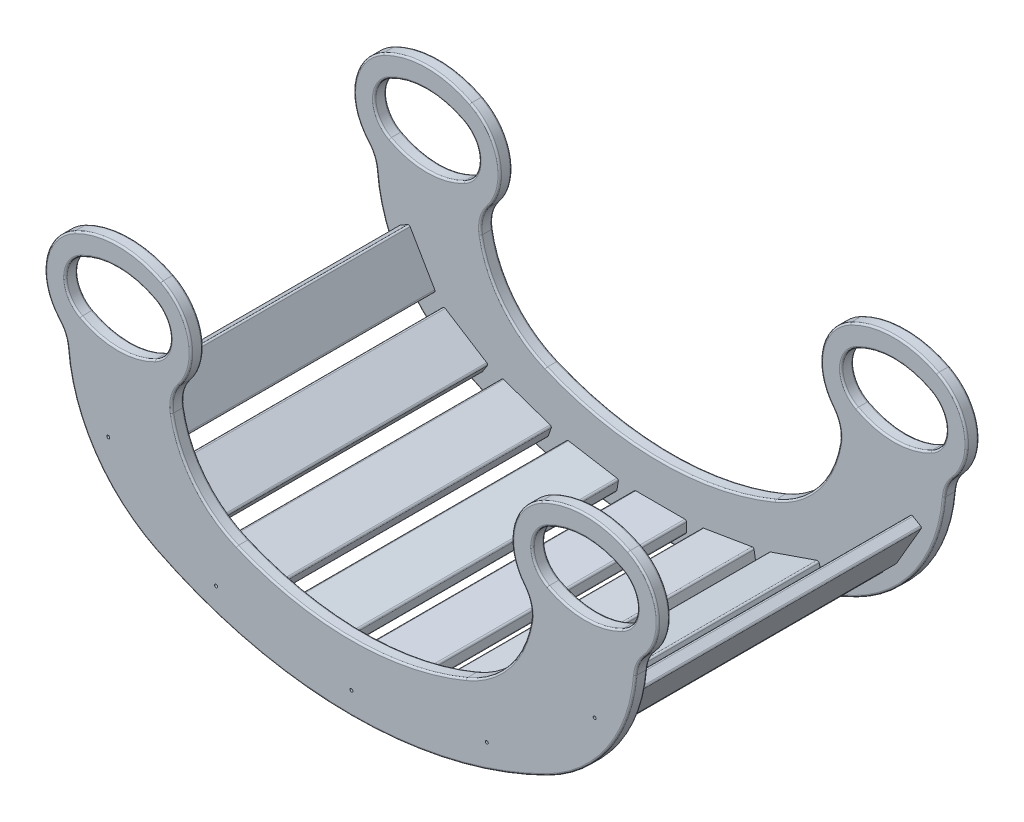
from build123d import *

# Parameters (mm, degrees)
SKETCH_2_W          = 90
SKETCH_2_H          = 21
EXTRUDE_1_DEPTH     = 10
EXTRUDE_START       = -11
EXTRUDE_2_DEPTH     = 11
SKETCH_4_R          = 2.5
CUT_EXTRUDE_1_DEPTH = 1164.159920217
FILLET_2_R          = 3
EXTRUDE_3_DEPTH     = 528
EXTRUDE_3_2_DEPTH   = 528
EXTRUDE_3_3_DEPTH   = 528
EXTRUDE_3_4_DEPTH   = 528
EXTRUDE_3_5_DEPTH   = 528
EXTRUDE_3_6_DEPTH   = 528
EXTRUDE_3_7_DEPTH   = 528
EXTRUDE_3_8_DEPTH   = 528
EXTRUDE_3_9_DEPTH   = 528
FILLET_3_R          = 3


with BuildPart() as part:
    # Sketch 2 → Extrude 1 (new body)
    with BuildSketch(Plane.XY):
        with BuildLine():
            ThreePointArc((50.245550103, 481.928030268), (125, 500), (199.754449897, 481.928030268))
            ThreePointArc((199.754449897, 481.928030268), (247.940880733, 419.051775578), (229.795836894, 341.940732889))
            ThreePointArc((229.795836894, 341.940732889), (218.622786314, 319.61675649), (217.501842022, 294.678022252))
            ThreePointArc((217.501842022, 294.678022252), (255.030373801, 210.070423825), (328.846153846, 154.230769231))
            ThreePointArc((328.846153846, 154.230769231), (525, 115), (721.153846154, 154.230769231))
            ThreePointArc((721.153846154, 154.230769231), (794.969626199, 210.070423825), (832.498157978, 294.678022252))
            ThreePointArc((832.498157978, 294.678022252), (831.377213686, 319.61675649), (820.204163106, 341.940732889))
            ThreePointArc((820.204163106, 341.940732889), (802.059119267, 419.051775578), (850.245550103, 481.928030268))
            ThreePointArc((850.245550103, 481.928030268), (925, 500), (999.754449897, 481.928030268))
            ThreePointArc((999.754449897, 481.928030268), (1048.461325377, 416.444496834), (1026.361057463, 337.882221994))
            ThreePointArc((1026.361057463, 337.882221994), (1015.908947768, 321.526061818), (1011.225482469, 302.688978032))
            ThreePointArc((1011.225482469, 302.688978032), (964.945149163, 170.966936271), (859.945317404, 78.947368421))
            ThreePointArc((859.945317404, 78.947368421), (525, 0), (190.054682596, 78.947368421))
            ThreePointArc((190.054682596, 78.947368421), (85.054850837, 170.966936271), (38.774517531, 302.688978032))
            ThreePointArc((38.774517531, 302.688978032), (34.091052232, 321.526061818), (23.638942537, 337.882221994))
            ThreePointArc((23.638942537, 337.882221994), (1.538674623, 416.444496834), (50.245550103, 481.928030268))
        make_face()
        Polygon((76.75766766, 239.64235719), (122.030807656, 161.858407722), (140.180395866, 172.422140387), (94.90725587, 250.206089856), align=None, mode=Mode.SUBTRACT)
        Polygon((142.852262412, 140.2605601), (218.927417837, 92.171364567), (230.148230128, 109.922234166), (154.073074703, 158.0114297), align=None, mode=Mode.SUBTRACT)
        Polygon((247.177476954, 82.075119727), (332.264757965, 52.746727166), (339.108049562, 72.600426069), (254.020768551, 101.928818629), align=None, mode=Mode.SUBTRACT)
        Polygon((361.339910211, 45.355142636), (450.103233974, 30.486640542), (453.572551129, 51.198082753), (364.809227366, 66.066584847), align=None, mode=Mode.SUBTRACT)
        with Locations((525, 38.5)):
            Rectangle(SKETCH_2_W, SKETCH_2_H, mode=Mode.SUBTRACT)
        Polygon((599.896766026, 30.486640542), (688.660089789, 45.355142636), (685.190772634, 66.066584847), (596.427448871, 51.198082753), align=None, mode=Mode.SUBTRACT)
        Polygon((717.735242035, 52.746727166), (802.822523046, 82.075119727), (795.979231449, 101.928818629), (710.891950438, 72.600426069), align=None, mode=Mode.SUBTRACT)
        Polygon((831.072582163, 92.171364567), (907.147737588, 140.2605601), (895.926925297, 158.0114297), (819.851769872, 109.922234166), align=None, mode=Mode.SUBTRACT)
        Polygon((909.819604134, 172.422140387), (927.969192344, 161.858407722), (973.24233234, 239.64235719), (955.09274413, 250.206089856), align=None, mode=Mode.SUBTRACT)
        with BuildLine():
            ThreePointArc((61.470588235, 449.117647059), (125, 465), (188.529411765, 449.117647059))
            ThreePointArc((188.529411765, 449.117647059), (215, 405), (188.529411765, 360.882352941))
            ThreePointArc((188.529411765, 360.882352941), (125, 345), (61.470588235, 360.882352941))
            ThreePointArc((61.470588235, 360.882352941), (35, 405), (61.470588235, 449.117647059))
        make_face(mode=Mode.SUBTRACT)
        with BuildLine():
            ThreePointArc((861.470588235, 449.117647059), (925, 465), (988.529411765, 449.117647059))
            ThreePointArc((988.529411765, 449.117647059), (1015, 405), (988.529411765, 360.882352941))
            ThreePointArc((988.529411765, 360.882352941), (925, 345), (861.470588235, 360.882352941))
            ThreePointArc((861.470588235, 360.882352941), (835, 405), (861.470588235, 449.117647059))
        make_face(mode=Mode.SUBTRACT)
    extrude(amount=EXTRUDE_1_DEPTH)

    # Sketch 2_2 → Extrude 2 (add)
    with BuildSketch(Plane.XY.offset(EXTRUDE_START)):
        with BuildLine():
            ThreePointArc((50.245550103, 481.928030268), (125, 500), (199.754449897, 481.928030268))
            ThreePointArc((199.754449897, 481.928030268), (247.940880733, 419.051775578), (229.795836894, 341.940732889))
            ThreePointArc((229.795836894, 341.940732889), (218.622786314, 319.61675649), (217.501842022, 294.678022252))
            ThreePointArc((217.501842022, 294.678022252), (255.030373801, 210.070423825), (328.846153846, 154.230769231))
            ThreePointArc((328.846153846, 154.230769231), (525, 115), (721.153846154, 154.230769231))
            ThreePointArc((721.153846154, 154.230769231), (794.969626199, 210.070423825), (832.498157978, 294.678022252))
            ThreePointArc((832.498157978, 294.678022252), (831.377213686, 319.61675649), (820.204163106, 341.940732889))
            ThreePointArc((820.204163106, 341.940732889), (802.059119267, 419.051775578), (850.245550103, 481.928030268))
            ThreePointArc((850.245550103, 481.928030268), (925, 500), (999.754449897, 481.928030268))
            ThreePointArc((999.754449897, 481.928030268), (1048.461325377, 416.444496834), (1026.361057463, 337.882221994))
            ThreePointArc((1026.361057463, 337.882221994), (1015.908947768, 321.526061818), (1011.225482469, 302.688978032))
            ThreePointArc((1011.225482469, 302.688978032), (964.945149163, 170.966936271), (859.945317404, 78.947368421))
            ThreePointArc((859.945317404, 78.947368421), (525, 0), (190.054682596, 78.947368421))
            ThreePointArc((190.054682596, 78.947368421), (85.054850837, 170.966936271), (38.774517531, 302.688978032))
            ThreePointArc((38.774517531, 302.688978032), (34.091052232, 321.526061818), (23.638942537, 337.882221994))
            ThreePointArc((23.638942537, 337.882221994), (1.538674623, 416.444496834), (50.245550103, 481.928030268))
        make_face()
        with BuildLine():
            ThreePointArc((61.470588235, 449.117647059), (125, 465), (188.529411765, 449.117647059))
            ThreePointArc((188.529411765, 449.117647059), (215, 405), (188.529411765, 360.882352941))
            ThreePointArc((188.529411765, 360.882352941), (125, 345), (61.470588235, 360.882352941))
            ThreePointArc((61.470588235, 360.882352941), (35, 405), (61.470588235, 449.117647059))
        make_face(mode=Mode.SUBTRACT)
        with BuildLine():
            ThreePointArc((861.470588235, 449.117647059), (925, 465), (988.529411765, 449.117647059))
            ThreePointArc((988.529411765, 449.117647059), (1015, 405), (988.529411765, 360.882352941))
            ThreePointArc((988.529411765, 360.882352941), (925, 345), (861.470588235, 360.882352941))
            ThreePointArc((861.470588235, 360.882352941), (835, 405), (861.470588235, 449.117647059))
        make_face(mode=Mode.SUBTRACT)
    extrude(amount=EXTRUDE_2_DEPTH)

    # Sketch 4 → Cut-Extrude 1 (cut, through all)
    with BuildSketch(Plane.XY.offset(10)):
        with Locations((108.469031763, 206.032248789)):
            Circle(SKETCH_4_R)
        with Locations((293.142763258, 77.337772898)):
            Circle(SKETCH_4_R)
        with Locations((525, 38.5)):
            Circle(SKETCH_4_R)
        with Locations((756.857236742, 77.337772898)):
            Circle(SKETCH_4_R)
        with Locations((941.530968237, 206.032248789)):
            Circle(SKETCH_4_R)
    extrude(amount=-CUT_EXTRUDE_1_DEPTH, mode=Mode.SUBTRACT)

    # Fillet 2
    fillet_2_edges = [part.edges().sort_by_distance(p)[0] for p in [
        (364.809227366, 66.066584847, 5),
        (361.339910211, 45.355142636, 5),
        (450.103233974, 30.486640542, 5),
        (453.572551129, 51.198082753, 5),
        (480, 49, 5),
        (480, 28, 5),
        (570, 28, 5),
        (570, 49, 5),
        (596.427448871, 51.198082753, 5),
        (599.896766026, 30.486640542, 5),
        (688.660089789, 45.355142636, 5),
        (685.190772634, 66.066584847, 5),
        (710.891950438, 72.600426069, 5),
        (717.735242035, 52.746727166, 5),
        (802.822523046, 82.075119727, 5),
        (795.979231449, 101.928818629, 5),
        (819.851769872, 109.922234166, 5),
        (831.072582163, 92.171364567, 5),
        (907.147737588, 140.2605601, 5),
        (895.926925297, 158.0114297, 5),
        (955.09274413, 250.206089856, 5),
        (909.819604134, 172.422140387, 5),
        (927.969192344, 161.858407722, 5),
        (973.24233234, 239.64235719, 5),
        (94.90725587, 250.206089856, 5),
        (76.75766766, 239.64235719, 5),
        (122.030807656, 161.858407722, 5),
        (140.180395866, 172.422140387, 5),
        (154.073074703, 158.0114297, 5),
        (142.852262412, 140.2605601, 5),
        (218.927417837, 92.171364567, 5),
        (230.148230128, 109.922234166, 5),
        (254.020768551, 101.928818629, 5),
        (247.177476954, 82.075119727, 5),
        (332.264757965, 52.746727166, 5),
        (339.108049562, 72.600426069, 5),
    ]]
    fillet(fillet_2_edges, radius=FILLET_2_R)

    # Fillet 3
    fillet_3_edges = [part.edges().sort_by_distance(p)[0] for p in [
        (85.054850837, 170.966936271, 10),
        (525, 0, 10),
        (964.945149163, 170.966936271, 10),
        (1015.908947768, 321.526061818, 10),
        (831.377213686, 319.61675649, -11),
        (802.059119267, 419.051775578, -11),
        (925, 500, -11),
        (1048.461325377, 416.444496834, -11),
        (1015.908947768, 321.526061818, -11),
        (964.945149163, 170.966936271, -11),
        (525, 0, -11),
        (85.054850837, 170.966936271, -11),
        (34.091052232, 321.526061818, -11),
        (1.538674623, 416.444496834, -11),
        (247.940880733, 419.051775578, -11),
        (218.622786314, 319.61675649, -11),
        (255.030373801, 210.070423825, -11),
        (525, 115, -11),
        (794.969626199, 210.070423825, -11),
        (35, 405, -11),
        (125, 345, -11),
        (215, 405, -11),
        (835, 405, -11),
        (925, 345, -11),
        (1015, 405, -11),
        (125, 500, -11),
        (925, 465, -11),
        (125, 465, -11),
        (1048.461325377, 416.444496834, 10),
        (925, 500, 10),
        (802.059119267, 419.051775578, 10),
        (831.377213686, 319.61675649, 10),
        (794.969626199, 210.070423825, 10),
        (525, 115, 10),
        (1.538674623, 416.444496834, 10),
        (255.030373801, 210.070423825, 10),
        (35, 405, 10),
        (218.622786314, 319.61675649, 10),
        (125, 345, 10),
        (215, 405, 10),
        (125, 465, 10),
        (247.940880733, 419.051775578, 10),
        (125, 500, 10),
        (835, 405, 10),
        (925, 345, 10),
        (1015, 405, 10),
        (925, 465, 10),
        (34.091052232, 321.526061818, 10),
    ]]
    fillet(fillet_3_edges, radius=FILLET_3_R)


with BuildPart() as body_2:
    # Sketch 5 → Extrude 3 (new body)
    with BuildSketch(Plane.XY):
        with BuildLine():
            ThreePointArc((821.454743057, 107.386395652), (821.063999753, 109.649004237), (822.387608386, 111.52520735))
            Line((822.387608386, 111.52520735), (893.391086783, 156.408456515))
            ThreePointArc((893.391086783, 156.408456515), (895.653695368, 156.799199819), (897.529898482, 155.475591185))
            Line((897.529898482, 155.475591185), (905.544764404, 142.796398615))
            ThreePointArc((905.544764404, 142.796398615), (905.935507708, 140.53379003), (904.611899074, 138.657586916))
            Line((904.611899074, 138.657586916), (833.608420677, 93.774337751))
            ThreePointArc((833.608420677, 93.774337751), (831.345812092, 93.383594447), (829.469608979, 94.707203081))
            Line((829.469608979, 94.707203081), (821.454743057, 107.386395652))
        make_face()
    extrude(amount=EXTRUDE_3_DEPTH)


with BuildPart() as body_3:
    # Sketch 5 → Extrude 3 2 (new body)
    with BuildSketch(Plane.XY):
        with BuildLine():
            Line((138.671291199, 175.014938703), (96.416360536, 247.61329154))
            ThreePointArc((96.416360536, 247.61329154), (94.589849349, 249.004670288), (92.314457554, 248.696985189))
            Line((92.314457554, 248.696985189), (79.350465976, 241.151461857))
            ThreePointArc((79.350465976, 241.151461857), (77.959087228, 239.324950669), (78.266772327, 237.049558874))
            Line((78.266772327, 237.049558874), (120.52170299, 164.451206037))
            ThreePointArc((120.52170299, 164.451206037), (122.348214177, 163.059827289), (124.623605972, 163.367512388))
            Line((124.623605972, 163.367512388), (137.58759755, 170.913035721))
            ThreePointArc((137.58759755, 170.913035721), (138.978976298, 172.739546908), (138.671291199, 175.014938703))
        make_face()
    extrude(amount=EXTRUDE_3_2_DEPTH)


with BuildPart() as body_4:
    # Sketch 5 → Extrude 3 3 (new body)
    with BuildSketch(Plane.XY):
        with BuildLine():
            Line((227.612391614, 111.52520735), (156.608913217, 156.408456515))
            ThreePointArc((156.608913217, 156.408456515), (154.346304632, 156.799199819), (152.470101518, 155.475591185))
            Line((152.470101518, 155.475591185), (144.455235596, 142.796398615))
            ThreePointArc((144.455235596, 142.796398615), (144.064492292, 140.53379003), (145.388100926, 138.657586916))
            Line((145.388100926, 138.657586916), (216.391579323, 93.774337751))
            ThreePointArc((216.391579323, 93.774337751), (218.654187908, 93.383594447), (220.530391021, 94.707203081))
            Line((220.530391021, 94.707203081), (228.545256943, 107.386395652))
            ThreePointArc((228.545256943, 107.386395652), (228.936000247, 109.649004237), (227.612391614, 111.52520735))
        make_face()
    extrude(amount=EXTRUDE_3_3_DEPTH)


with BuildPart() as body_5:
    # Sketch 5 → Extrude 3 4 (new body)
    with BuildSketch(Plane.XY):
        with BuildLine():
            Line((256.857011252, 100.951205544), (336.271806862, 73.578039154))
            ThreePointArc((336.271806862, 73.578039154), (337.990997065, 72.056046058), (338.130436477, 69.764183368))
            Line((338.130436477, 69.764183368), (333.24237105, 55.582969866))
            ThreePointArc((333.24237105, 55.582969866), (331.720377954, 53.863779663), (329.428515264, 53.724340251))
            Line((329.428515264, 53.724340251), (250.013719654, 81.097506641))
            ThreePointArc((250.013719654, 81.097506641), (248.294529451, 82.619499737), (248.155090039, 84.911362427))
            Line((248.155090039, 84.911362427), (253.043155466, 99.092575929))
            ThreePointArc((253.043155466, 99.092575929), (254.565148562, 100.811766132), (256.857011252, 100.951205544))
        make_face()
    extrude(amount=EXTRUDE_3_4_DEPTH)


with BuildPart() as body_6:
    # Sketch 5 → Extrude 3 5 (new body)
    with BuildSketch(Plane.XY):
        with BuildLine():
            Line((450.61377367, 51.69369949), (367.768004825, 65.57096811))
            ThreePointArc((367.768004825, 65.57096811), (365.530670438, 65.054816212), (364.31361063, 63.107807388))
            Line((364.31361063, 63.107807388), (361.835526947, 48.313920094))
            ThreePointArc((361.835526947, 48.313920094), (362.351678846, 46.076585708), (364.29868767, 44.859525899))
            Line((364.29868767, 44.859525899), (447.144456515, 30.982257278))
            ThreePointArc((447.144456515, 30.982257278), (449.381790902, 31.498409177), (450.59885071, 33.445418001))
            Line((450.59885071, 33.445418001), (453.076934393, 48.239305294))
            ThreePointArc((453.076934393, 48.239305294), (452.560782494, 50.476639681), (450.61377367, 51.69369949))
        make_face()
    extrude(amount=EXTRUDE_3_5_DEPTH)


with BuildPart() as body_7:
    # Sketch 5 → Extrude 3 6 (new body)
    with BuildSketch(Plane.XY):
        with BuildLine():
            Line((599.38622633, 51.69369949), (682.231995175, 65.57096811))
            ThreePointArc((682.231995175, 65.57096811), (684.469329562, 65.054816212), (685.68638937, 63.107807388))
            Line((685.68638937, 63.107807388), (688.164473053, 48.313920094))
            ThreePointArc((688.164473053, 48.313920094), (687.648321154, 46.076585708), (685.70131233, 44.859525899))
            Line((685.70131233, 44.859525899), (602.855543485, 30.982257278))
            ThreePointArc((602.855543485, 30.982257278), (600.618209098, 31.498409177), (599.40114929, 33.445418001))
            Line((599.40114929, 33.445418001), (596.923065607, 48.239305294))
            ThreePointArc((596.923065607, 48.239305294), (597.439217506, 50.476639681), (599.38622633, 51.69369949))
        make_face()
    extrude(amount=EXTRUDE_3_6_DEPTH)


with BuildPart() as body_8:
    # Sketch 5 → Extrude 3 7 (new body)
    with BuildSketch(Plane.XY):
        with BuildLine():
            Line((911.328708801, 175.014938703), (953.583639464, 247.61329154))
            ThreePointArc((953.583639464, 247.61329154), (955.410150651, 249.004670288), (957.685542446, 248.696985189))
            Line((957.685542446, 248.696985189), (970.649534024, 241.151461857))
            ThreePointArc((970.649534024, 241.151461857), (972.040912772, 239.324950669), (971.733227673, 237.049558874))
            Line((971.733227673, 237.049558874), (929.47829701, 164.451206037))
            ThreePointArc((929.47829701, 164.451206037), (927.651785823, 163.059827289), (925.376394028, 163.367512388))
            Line((925.376394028, 163.367512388), (912.41240245, 170.913035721))
            ThreePointArc((912.41240245, 170.913035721), (911.021023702, 172.739546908), (911.328708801, 175.014938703))
        make_face()
    extrude(amount=EXTRUDE_3_7_DEPTH)


with BuildPart() as body_9:
    # Sketch 5 → Extrude 3 8 (new body)
    with BuildSketch(Plane.XY):
        with BuildLine():
            Line((483, 49), (567, 49))
            ThreePointArc((567, 49), (569.121320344, 48.121320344), (570, 46))
            Line((570, 46), (570, 31))
            ThreePointArc((570, 31), (569.121320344, 28.878679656), (567, 28))
            Line((567, 28), (483, 28))
            ThreePointArc((483, 28), (480.878679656, 28.878679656), (480, 31))
            Line((480, 31), (480, 46))
            ThreePointArc((480, 46), (480.878679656, 48.121320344), (483, 49))
        make_face()
    extrude(amount=EXTRUDE_3_8_DEPTH)


with BuildPart() as body_10:
    # Sketch 5 → Extrude 3 9 (new body)
    with BuildSketch(Plane.XY):
        with BuildLine():
            Line((713.728193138, 73.578039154), (793.142988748, 100.951205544))
            ThreePointArc((793.142988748, 100.951205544), (795.434851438, 100.811766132), (796.956844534, 99.092575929))
            Line((796.956844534, 99.092575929), (801.844909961, 84.911362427))
            ThreePointArc((801.844909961, 84.911362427), (801.705470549, 82.619499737), (799.986280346, 81.097506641))
            Line((799.986280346, 81.097506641), (720.571484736, 53.724340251))
            ThreePointArc((720.571484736, 53.724340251), (718.279622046, 53.863779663), (716.75762895, 55.582969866))
            Line((716.75762895, 55.582969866), (711.869563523, 69.764183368))
            ThreePointArc((711.869563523, 69.764183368), (712.009002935, 72.056046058), (713.728193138, 73.578039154))
        make_face()
    extrude(amount=EXTRUDE_3_9_DEPTH)


with BuildPart() as body_11:
    # Mirror 1: mirrored copy
    add(part.part.mirror(Plane.XY.offset(264)))


solid = Compound([part.part, body_2.part, body_3.part, body_4.part, body_5.part, body_6.part, body_7.part, body_8.part, body_9.part, body_10.part, body_11.part])
